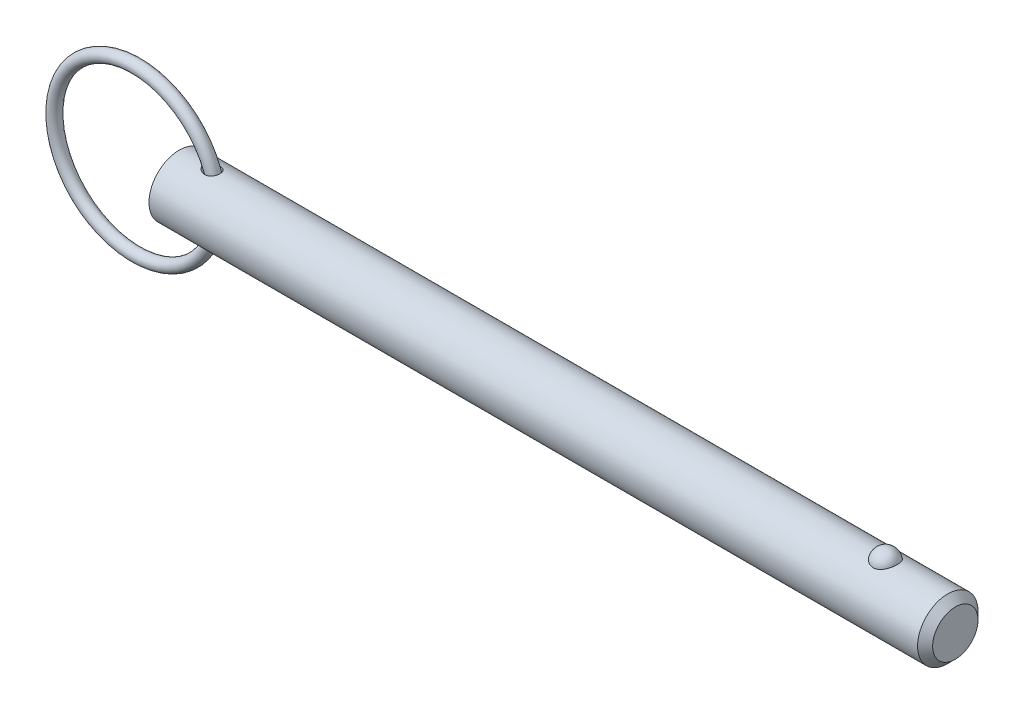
ISO-10303-21;
HEADER;
FILE_DESCRIPTION(('STEP AP214'),'2;1');
FILE_NAME('part.step','',(''),(''),'','','');
FILE_SCHEMA(('AUTOMOTIVE_DESIGN { 1 0 10303 214 1 1 1 1 }'));
ENDSEC;
DATA;
#1=APPLICATION_CONTEXT('core data for automotive mechanical design processes');
#2=APPLICATION_PROTOCOL_DEFINITION('international standard','automotive_design',2000,#1);
#3=PRODUCT_CONTEXT('',#1,'mechanical');
#4=PRODUCT('Part','Part','',(#3));
#5=PRODUCT_RELATED_PRODUCT_CATEGORY('part','',(#4));
#6=PRODUCT_DEFINITION_FORMATION('','',#4);
#7=PRODUCT_DEFINITION_CONTEXT('part definition',#1,'design');
#8=PRODUCT_DEFINITION('design','',#6,#7);
#9=PRODUCT_DEFINITION_SHAPE('','',#8);
#10=(LENGTH_UNIT() NAMED_UNIT(*) SI_UNIT(.MILLI.,.METRE.));
#11=(NAMED_UNIT(*) PLANE_ANGLE_UNIT() SI_UNIT($,.RADIAN.));
#12=(NAMED_UNIT(*) SI_UNIT($,.STERADIAN.) SOLID_ANGLE_UNIT());
#13=UNCERTAINTY_MEASURE_WITH_UNIT(LENGTH_MEASURE(1.E-05),#10,'distance_accuracy_value','');
#14=(GEOMETRIC_REPRESENTATION_CONTEXT(3) GLOBAL_UNCERTAINTY_ASSIGNED_CONTEXT((#13)) GLOBAL_UNIT_ASSIGNED_CONTEXT((#10,
#11,#12)) REPRESENTATION_CONTEXT('',''));
#15=CARTESIAN_POINT('',(0.,0.,0.));
#16=DIRECTION('',(0.,0.,1.));
#17=DIRECTION('',(1.,0.,0.));
#18=AXIS2_PLACEMENT_3D('',#15,#16,#17);
#19=CARTESIAN_POINT('',(-6.70471658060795,0.,0.));
#20=DIRECTION('',(0.,0.,1.));
#21=DIRECTION('',(1.,0.,0.));
#22=AXIS2_PLACEMENT_3D('',#19,#20,#21);
#23=TOROIDAL_SURFACE('',#22,12.7,0.940000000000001);
#24=CARTESIAN_POINT('',(6.93528341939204,0.,0.));
#25=VERTEX_POINT('',#24);
#26=VERTEX_LOOP('',#25);
#27=FACE_BOUND('',#26,.T.);
#28=ADVANCED_FACE('P0_F12',(#27),#23,.T.);
#29=CLOSED_SHELL('',(#28));
#30=MANIFOLD_SOLID_BREP('P0_B1',#29);
#31=CARTESIAN_POINT('',(0.,0.,0.));
#32=DIRECTION('',(1.,0.,0.));
#33=DIRECTION('',(0.,0.,-1.));
#34=AXIS2_PLACEMENT_3D('',#31,#32,#33);
#35=CYLINDRICAL_SURFACE('',#34,4.7);
#36=CARTESIAN_POINT('',(4.16378072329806,4.63584137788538,-0.773934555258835));
#37=CARTESIAN_POINT('',(4.22041228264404,4.62659903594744,-0.829297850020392));
#38=CARTESIAN_POINT('',(4.28206987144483,4.61719767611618,-0.879522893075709));
#39=CARTESIAN_POINT('',(4.41303152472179,4.59925351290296,-0.968997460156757));
#40=CARTESIAN_POINT('',(4.4823442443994,4.59071170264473,-1.00823437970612));
#41=CARTESIAN_POINT('',(4.626507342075,4.5755493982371,-1.07495006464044));
#42=CARTESIAN_POINT('',(4.70135029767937,4.56892638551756,-1.10244426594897));
#43=CARTESIAN_POINT('',(4.85470490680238,4.55848940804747,-1.14483874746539));
#44=CARTESIAN_POINT('',(4.93321503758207,4.55467428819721,-1.15974420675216));
#45=CARTESIAN_POINT('',(5.09197970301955,4.55051176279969,-1.17597559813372));
#46=CARTESIAN_POINT('',(5.17223836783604,4.55017372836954,-1.17726483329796));
#47=CARTESIAN_POINT('',(5.33159446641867,4.55326696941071,-1.16524823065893));
#48=CARTESIAN_POINT('',(5.41069268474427,4.55669556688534,-1.15195276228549));
#49=CARTESIAN_POINT('',(5.55698758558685,4.56647801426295,-1.11249214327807));
#50=CARTESIAN_POINT('',(5.62458628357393,4.57250771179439,-1.08773548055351));
#51=CARTESIAN_POINT('',(5.75397700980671,4.58665356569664,-1.02644632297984));
#52=CARTESIAN_POINT('',(5.81577171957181,4.59476875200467,-0.989919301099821));
#53=CARTESIAN_POINT('',(5.9268148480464,4.61135052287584,-0.909391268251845));
#54=CARTESIAN_POINT('',(5.9766679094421,4.61973919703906,-0.866204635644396));
#55=CARTESIAN_POINT('',(6.06817854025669,4.63643253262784,-0.771868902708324));
#56=CARTESIAN_POINT('',(6.10983710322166,4.64473720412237,-0.720720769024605));
#57=CARTESIAN_POINT('',(6.18318089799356,4.660174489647,-0.612928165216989));
#58=CARTESIAN_POINT('',(6.21503150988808,4.66732544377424,-0.556398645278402));
#59=CARTESIAN_POINT('',(6.26900210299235,4.67985590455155,-0.438689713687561));
#60=CARTESIAN_POINT('',(6.29112194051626,4.68523538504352,-0.377510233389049));
#61=CARTESIAN_POINT('',(6.32523846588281,4.6936733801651,-0.251831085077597));
#62=CARTESIAN_POINT('',(6.33717189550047,4.69671737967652,-0.187313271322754));
#63=CARTESIAN_POINT('',(6.35042407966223,4.70010386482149,-0.0571258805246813));
#64=CARTESIAN_POINT('',(6.3517424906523,4.70044626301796,0.00854373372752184));
#65=CARTESIAN_POINT('',(6.34371729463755,4.69838816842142,0.139481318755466));
#66=CARTESIAN_POINT('',(6.33432596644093,4.69597539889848,0.204746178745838));
#67=CARTESIAN_POINT('',(6.30500866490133,4.68864655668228,0.332720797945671));
#68=CARTESIAN_POINT('',(6.28508259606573,4.68373046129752,0.39543053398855));
#69=CARTESIAN_POINT('',(6.23516511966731,4.67193431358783,0.516455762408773));
#70=CARTESIAN_POINT('',(6.20518126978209,4.66505573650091,0.574774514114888));
#71=CARTESIAN_POINT('',(6.1358631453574,4.65009270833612,0.685387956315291));
#72=CARTESIAN_POINT('',(6.09652950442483,4.64200833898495,0.737683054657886));
#73=CARTESIAN_POINT('',(6.00979078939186,4.62559001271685,0.834455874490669));
#74=CARTESIAN_POINT('',(5.96243625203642,4.61725787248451,0.878979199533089));
#75=CARTESIAN_POINT('',(5.86079843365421,4.60122574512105,0.959378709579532));
#76=CARTESIAN_POINT('',(5.80651591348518,4.59352568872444,0.995255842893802));
#77=CARTESIAN_POINT('',(5.69277386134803,4.57961669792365,1.05741527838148));
#78=CARTESIAN_POINT('',(5.63333134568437,4.57340309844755,1.08372773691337));
#79=CARTESIAN_POINT('',(5.5108424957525,4.56305640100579,1.12650026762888));
#80=CARTESIAN_POINT('',(5.44779577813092,4.55892352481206,1.14295928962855));
#81=CARTESIAN_POINT('',(5.3179566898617,4.55299444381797,1.1663590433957));
#82=CARTESIAN_POINT('',(5.25110869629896,4.55127026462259,1.17300670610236));
#83=CARTESIAN_POINT('',(5.11716812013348,4.55043953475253,1.17622268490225));
#84=CARTESIAN_POINT('',(5.05007546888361,4.55133378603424,1.17278791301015));
#85=CARTESIAN_POINT('',(4.91166083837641,4.55569951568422,1.15571913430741));
#86=CARTESIAN_POINT('',(4.84044690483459,4.55937764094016,1.1412666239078));
#87=CARTESIAN_POINT('',(4.70108819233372,4.56903562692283,1.10196123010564));
#88=CARTESIAN_POINT('',(4.63294574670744,4.57501720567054,1.07710058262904));
#89=CARTESIAN_POINT('',(4.4947730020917,4.58927184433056,1.01474439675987));
#90=CARTESIAN_POINT('',(4.42520748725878,4.59771156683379,0.976252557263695));
#91=CARTESIAN_POINT('',(4.29354165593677,4.61552030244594,0.888246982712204));
#92=CARTESIAN_POINT('',(4.23143936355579,4.62488906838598,0.838736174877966));
#93=CARTESIAN_POINT('',(4.12609666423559,4.64192969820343,0.738015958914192));
#94=CARTESIAN_POINT('',(4.08142630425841,4.64963595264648,0.688308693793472));
#95=CARTESIAN_POINT('',(4.0008117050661,4.66411457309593,0.582144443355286));
#96=CARTESIAN_POINT('',(3.96485623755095,4.6708881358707,0.525696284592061));
#97=CARTESIAN_POINT('',(3.9081839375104,4.68183565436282,0.41591755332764));
#98=CARTESIAN_POINT('',(3.88599581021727,4.68624644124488,0.363372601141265));
#99=CARTESIAN_POINT('',(3.85055971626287,4.693376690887,0.255230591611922));
#100=CARTESIAN_POINT('',(3.83730635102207,4.69609717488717,0.199635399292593));
#101=CARTESIAN_POINT('',(3.82058225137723,4.69954043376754,0.0867104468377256));
#102=CARTESIAN_POINT('',(3.81714632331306,4.70025610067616,0.0293752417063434));
#103=CARTESIAN_POINT('',(3.8204140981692,4.69957935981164,-0.084992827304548));
#104=CARTESIAN_POINT('',(3.82711802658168,4.69818690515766,-0.142025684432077));
#105=CARTESIAN_POINT('',(3.84950128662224,4.69360426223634,-0.250744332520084));
#106=CARTESIAN_POINT('',(3.86463891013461,4.69052274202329,-0.302548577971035));
#107=CARTESIAN_POINT('',(3.9026119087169,4.68295207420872,-0.403121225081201));
#108=CARTESIAN_POINT('',(3.92544863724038,4.67846267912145,-0.451889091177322));
#109=CARTESIAN_POINT('',(3.9799930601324,4.6680441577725,-0.549522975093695));
#110=CARTESIAN_POINT('',(4.01228648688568,4.66202553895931,-0.598050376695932));
#111=CARTESIAN_POINT('',(4.08340845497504,4.64931397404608,-0.689954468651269));
#112=CARTESIAN_POINT('',(4.1222426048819,4.64262045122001,-0.733326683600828));
#113=CARTESIAN_POINT('',(4.16378072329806,4.63584137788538,-0.773934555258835));
#114=B_SPLINE_CURVE_WITH_KNOTS('',3,(#36,#37,#38,#39,#40,#41,#42,#43,#44,#45,#46,#47,#48,#49,
#50,#51,#52,#53,#54,#55,#56,#57,#58,#59,#60,#61,#62,#63,#64,#65,#66,#67,#68,#69,#70,#71,#72,#73,
#74,#75,#76,#77,#78,#79,#80,#81,#82,#83,#84,#85,#86,#87,#88,#89,#90,#91,#92,#93,#94,#95,#96,#97,
#98,#99,#100,#101,#102,#103,#104,#105,#106,#107,#108,#109,#110,#111,#112,#113),.UNSPECIFIED.,
.T.,.F.,(4,2,2,2,2,2,2,2,2,2,2,2,2,2,2,2,2,2,2,2,2,2,2,2,2,2,2,2,2,2,2,2,2,2,2,2,2,2,4),(0.,
0.238977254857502,0.478227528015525,0.717162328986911,0.955998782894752,1.19547875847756,
1.43478857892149,1.65034375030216,1.86579883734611,2.06429861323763,2.2627743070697,
2.45769248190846,2.65261353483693,2.848736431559,3.04486567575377,3.24187227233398,
3.43888065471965,3.63574133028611,3.83258866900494,4.0282389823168,4.22386782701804,
4.41887441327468,4.61390177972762,4.81464443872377,5.0154485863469,5.23282834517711,
5.45037055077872,5.68914354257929,5.9278531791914,6.12887730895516,6.32964104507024,
6.50053592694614,6.67132745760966,6.84272375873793,7.01412387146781,7.17560768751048,
7.33711990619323,7.51225400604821,7.68753905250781),.UNSPECIFIED.);
#115=CARTESIAN_POINT('',(4.16378072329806,4.63584137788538,-0.773934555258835));
#116=VERTEX_POINT('',#115);
#117=EDGE_CURVE('P1_E40',#116,#116,#114,.T.);
#118=ORIENTED_EDGE('',*,*,#117,.T.);
#119=EDGE_LOOP('',(#118));
#120=FACE_BOUND('',#119,.T.);
#121=CARTESIAN_POINT('',(119.475,0.,0.));
#122=DIRECTION('',(1.,0.,0.));
#123=DIRECTION('',(0.,0.,-1.));
#124=AXIS2_PLACEMENT_3D('',#121,#122,#123);
#125=CIRCLE('',#124,4.7);
#126=CARTESIAN_POINT('',(119.475,0.,-4.7));
#127=VERTEX_POINT('',#126);
#128=EDGE_CURVE('P1_E25',#127,#127,#125,.T.);
#129=ORIENTED_EDGE('',*,*,#128,.F.);
#130=EDGE_LOOP('',(#129));
#131=FACE_BOUND('',#130,.T.);
#132=CARTESIAN_POINT('',(0.,0.,0.));
#133=DIRECTION('',(1.,0.,0.));
#134=DIRECTION('',(0.,0.,-1.));
#135=AXIS2_PLACEMENT_3D('',#132,#133,#134);
#136=CIRCLE('',#135,4.7);
#137=CARTESIAN_POINT('',(0.,0.,-4.7));
#138=VERTEX_POINT('',#137);
#139=EDGE_CURVE('P1_E9',#138,#138,#136,.T.);
#140=ORIENTED_EDGE('',*,*,#139,.T.);
#141=EDGE_LOOP('',(#140));
#142=FACE_BOUND('',#141,.T.);
#143=CARTESIAN_POINT('',(109.78062830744,4.30387706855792,1.88855557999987));
#144=CARTESIAN_POINT('',(109.682813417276,4.30388592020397,1.88854684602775));
#145=CARTESIAN_POINT('',(109.584851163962,4.30731231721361,1.88078712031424));
#146=CARTESIAN_POINT('',(109.391662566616,4.32065009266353,1.84993192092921));
#147=CARTESIAN_POINT('',(109.296443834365,4.33057798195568,1.82679740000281));
#148=CARTESIAN_POINT('',(109.11181755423,4.3557457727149,1.76594245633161));
#149=CARTESIAN_POINT('',(109.022395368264,4.37097162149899,1.72826059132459));
#150=CARTESIAN_POINT('',(108.851390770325,4.4050778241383,1.6393730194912));
#151=CARTESIAN_POINT('',(108.769805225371,4.4239567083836,1.58817274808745));
#152=CARTESIAN_POINT('',(108.613901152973,4.46404088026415,1.47181116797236));
#153=CARTESIAN_POINT('',(108.539875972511,4.48529915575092,1.40627540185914));
#154=CARTESIAN_POINT('',(108.403536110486,4.527485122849,1.26387806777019));
#155=CARTESIAN_POINT('',(108.341224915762,4.54841271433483,1.18701313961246));
#156=CARTESIAN_POINT('',(108.227072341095,4.58876216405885,1.02025841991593));
#157=CARTESIAN_POINT('',(108.175811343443,4.60807744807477,0.929944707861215));
#158=CARTESIAN_POINT('',(108.08842456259,4.6421320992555,0.741468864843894));
#159=CARTESIAN_POINT('',(108.052299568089,4.65687122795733,0.643306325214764));
#160=CARTESIAN_POINT('',(107.995671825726,4.68038485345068,0.440967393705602));
#161=CARTESIAN_POINT('',(107.975304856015,4.68910744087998,0.336746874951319));
#162=CARTESIAN_POINT('',(107.951132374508,4.69949255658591,0.126059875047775));
#163=CARTESIAN_POINT('',(107.947326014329,4.70115544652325,0.0195935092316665));
#164=CARTESIAN_POINT('',(107.956308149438,4.69727256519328,-0.191500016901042));
#165=CARTESIAN_POINT('',(107.968941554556,4.69179416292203,-0.296135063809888));
#166=CARTESIAN_POINT('',(108.010276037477,4.67429351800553,-0.501612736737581));
#167=CARTESIAN_POINT('',(108.038977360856,4.66227117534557,-0.602455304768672));
#168=CARTESIAN_POINT('',(108.111928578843,4.63286427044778,-0.79770793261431));
#169=CARTESIAN_POINT('',(108.156204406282,4.61547077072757,-0.892106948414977));
#170=CARTESIAN_POINT('',(108.259407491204,4.57709900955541,-1.07173134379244));
#171=CARTESIAN_POINT('',(108.318336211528,4.55612039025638,-1.15695580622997));
#172=CARTESIAN_POINT('',(108.450216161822,4.51257918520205,-1.31664252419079));
#173=CARTESIAN_POINT('',(108.523286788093,4.49000423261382,-1.39100294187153));
#174=CARTESIAN_POINT('',(108.681478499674,4.44594443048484,-1.52598548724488));
#175=CARTESIAN_POINT('',(108.766599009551,4.42445952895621,-1.58660827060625));
#176=CARTESIAN_POINT('',(108.945267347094,4.38543655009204,-1.69145998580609));
#177=CARTESIAN_POINT('',(109.038651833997,4.36783887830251,-1.73594433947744));
#178=CARTESIAN_POINT('',(109.23242205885,4.3382941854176,-1.8085227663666));
#179=CARTESIAN_POINT('',(109.332805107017,4.32634500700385,-1.83662309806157));
#180=CARTESIAN_POINT('',(109.53228752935,4.31005085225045,-1.87453136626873));
#181=CARTESIAN_POINT('',(109.631196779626,4.30535309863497,-1.88518956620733));
#182=CARTESIAN_POINT('',(109.829521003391,4.30299844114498,-1.89055986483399));
#183=CARTESIAN_POINT('',(109.928935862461,4.30534000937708,-1.88527542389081));
#184=CARTESIAN_POINT('',(110.12186386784,4.31657737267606,-1.85939299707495));
#185=CARTESIAN_POINT('',(110.215462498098,4.32524571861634,-1.83932621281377));
#186=CARTESIAN_POINT('',(110.397783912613,4.34791518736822,-1.7850744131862));
#187=CARTESIAN_POINT('',(110.486506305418,4.36191673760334,-1.75088826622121));
#188=CARTESIAN_POINT('',(110.658694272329,4.39411605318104,-1.66845234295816));
#189=CARTESIAN_POINT('',(110.742008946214,4.41239631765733,-1.61992036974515));
#190=CARTESIAN_POINT('',(110.899399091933,4.45109244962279,-1.51034589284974));
#191=CARTESIAN_POINT('',(110.973472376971,4.47150882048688,-1.44930043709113));
#192=CARTESIAN_POINT('',(111.114405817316,4.51353865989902,-1.31275193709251));
#193=CARTESIAN_POINT('',(111.180701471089,4.53515983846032,-1.23666813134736));
#194=CARTESIAN_POINT('',(111.300069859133,4.57635116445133,-1.07425533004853));
#195=CARTESIAN_POINT('',(111.35314024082,4.59592094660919,-0.987924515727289));
#196=CARTESIAN_POINT('',(111.446443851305,4.63161819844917,-0.804428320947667));
#197=CARTESIAN_POINT('',(111.486229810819,4.64762063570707,-0.707010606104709));
#198=CARTESIAN_POINT('',(111.549825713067,4.67374032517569,-0.506344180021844));
#199=CARTESIAN_POINT('',(111.573635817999,4.68385763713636,-0.403095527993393));
#200=CARTESIAN_POINT('',(111.604751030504,4.69716075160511,-0.193975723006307));
#201=CARTESIAN_POINT('',(111.612098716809,4.70036443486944,-0.088112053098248));
#202=CARTESIAN_POINT('',(111.610261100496,4.6995691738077,0.123441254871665));
#203=CARTESIAN_POINT('',(111.601076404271,4.69557049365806,0.229130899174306));
#204=CARTESIAN_POINT('',(111.566492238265,4.68082941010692,0.436545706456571));
#205=CARTESIAN_POINT('',(111.541209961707,4.67013575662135,0.53829393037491));
#206=CARTESIAN_POINT('',(111.475050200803,4.64311776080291,0.735797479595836));
#207=CARTESIAN_POINT('',(111.434171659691,4.62679303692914,0.831552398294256));
#208=CARTESIAN_POINT('',(111.337286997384,4.59002712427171,1.01512750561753));
#209=CARTESIAN_POINT('',(111.281173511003,4.56955699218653,1.10288523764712));
#210=CARTESIAN_POINT('',(111.15510852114,4.52671789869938,1.26730106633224));
#211=CARTESIAN_POINT('',(111.085157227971,4.50434896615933,1.34395933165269));
#212=CARTESIAN_POINT('',(110.932724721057,4.46008413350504,1.48428028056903));
#213=CARTESIAN_POINT('',(110.850209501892,4.43818970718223,1.54790656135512));
#214=CARTESIAN_POINT('',(110.674735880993,4.39746476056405,1.6600850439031));
#215=CARTESIAN_POINT('',(110.581773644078,4.37863537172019,1.70863168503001));
#216=CARTESIAN_POINT('',(110.391099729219,4.34688784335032,1.78783023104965));
#217=CARTESIAN_POINT('',(110.293629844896,4.33380220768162,1.81899757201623));
#218=CARTESIAN_POINT('',(110.094405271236,4.31435159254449,1.86467392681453));
#219=CARTESIAN_POINT('',(109.992663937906,4.30796708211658,1.87923136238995));
#220=CARTESIAN_POINT('',(109.85391360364,4.3043503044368,1.8874737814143));
#221=CARTESIAN_POINT('',(109.81728130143,4.30387375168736,1.8885588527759));
#222=CARTESIAN_POINT('',(109.78062830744,4.30387706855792,1.88855557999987));
#223=B_SPLINE_CURVE_WITH_KNOTS('',3,(#143,#144,#145,#146,#147,#148,#149,#150,#151,#152,#153,
#154,#155,#156,#157,#158,#159,#160,#161,#162,#163,#164,#165,#166,#167,#168,#169,#170,#171,#172,
#173,#174,#175,#176,#177,#178,#179,#180,#181,#182,#183,#184,#185,#186,#187,#188,#189,#190,#191,
#192,#193,#194,#195,#196,#197,#198,#199,#200,#201,#202,#203,#204,#205,#206,#207,#208,#209,#210,
#211,#212,#213,#214,#215,#216,#217,#218,#219,#220,#221,#222),.UNSPECIFIED.,.T.,.F.,(4,2,2,2,2,2,
2,2,2,2,2,2,2,2,2,2,2,2,2,2,2,2,2,2,2,2,2,2,2,2,2,2,2,2,2,2,2,2,2,4),(0.,0.293339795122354,
0.587427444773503,0.880740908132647,1.17393661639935,1.47597417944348,1.77810150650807,
2.09350493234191,2.40892479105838,2.72703308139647,3.04512507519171,3.36023788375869,
3.67535550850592,3.99100033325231,4.30667668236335,4.62514463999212,4.94359739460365,
5.25676407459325,5.56981105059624,5.86708641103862,6.1642972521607,6.45131888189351,
6.73836351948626,7.03148013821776,7.3246659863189,7.63288296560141,7.94115473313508,
8.25895074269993,8.57674352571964,8.89371340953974,9.21067166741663,9.52534839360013,
9.84004644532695,10.157022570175,10.4739938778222,10.7918388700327,11.1098009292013,
11.41774884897,11.7247967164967,11.834716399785),.UNSPECIFIED.);
#224=CARTESIAN_POINT('',(109.78062830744,4.30387706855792,1.88855557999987));
#225=VERTEX_POINT('',#224);
#226=EDGE_CURVE('P1_E34',#225,#225,#223,.T.);
#227=ORIENTED_EDGE('',*,*,#226,.T.);
#228=EDGE_LOOP('',(#227));
#229=FACE_BOUND('',#228,.T.);
#230=CARTESIAN_POINT('',(4.16378072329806,-4.63584137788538,-0.773934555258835));
#231=CARTESIAN_POINT('',(4.11797605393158,-4.64331682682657,-0.729154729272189));
#232=CARTESIAN_POINT('',(4.07545237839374,-4.65068929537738,-0.681007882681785));
#233=CARTESIAN_POINT('',(3.99850919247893,-4.66454993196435,-0.578483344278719));
#234=CARTESIAN_POINT('',(3.9640846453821,-4.67103864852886,-0.524109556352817));
#235=CARTESIAN_POINT('',(3.90486465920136,-4.68247538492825,-0.409579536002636));
#236=CARTESIAN_POINT('',(3.88014787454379,-4.68741075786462,-0.349380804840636));
#237=CARTESIAN_POINT('',(3.84254060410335,-4.69500854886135,-0.225256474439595));
#238=CARTESIAN_POINT('',(3.8296375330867,-4.69767338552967,-0.161334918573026));
#239=CARTESIAN_POINT('',(3.81750619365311,-4.70018000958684,-0.0396774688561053));
#240=CARTESIAN_POINT('',(3.8168623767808,-4.70031401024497,0.017913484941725));
#241=CARTESIAN_POINT('',(3.82570055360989,-4.69848615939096,0.132270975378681));
#242=CARTESIAN_POINT('',(3.83518142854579,-4.6965245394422,0.189037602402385));
#243=CARTESIAN_POINT('',(3.8627670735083,-4.69091189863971,0.296808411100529));
#244=CARTESIAN_POINT('',(3.88034293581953,-4.68736483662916,0.347956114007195));
#245=CARTESIAN_POINT('',(3.92293217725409,-4.67896699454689,0.446919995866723));
#246=CARTESIAN_POINT('',(3.94794743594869,-4.67411588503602,0.494735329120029));
#247=CARTESIAN_POINT('',(4.00723361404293,-4.66297432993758,0.590975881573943));
#248=CARTESIAN_POINT('',(4.04218787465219,-4.65658759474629,0.638966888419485));
#249=CARTESIAN_POINT('',(4.11850165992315,-4.6432741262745,0.729452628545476));
#250=CARTESIAN_POINT('',(4.15986486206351,-4.63634708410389,0.771944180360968));
#251=CARTESIAN_POINT('',(4.25563139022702,-4.62124878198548,0.858077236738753));
#252=CARTESIAN_POINT('',(4.3110472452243,-4.61307408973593,0.900593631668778));
#253=CARTESIAN_POINT('',(4.42760239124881,-4.59748077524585,0.977085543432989));
#254=CARTESIAN_POINT('',(4.48874590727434,-4.59006271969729,1.01105468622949));
#255=CARTESIAN_POINT('',(4.62409915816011,-4.57577604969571,1.07399161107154));
#256=CARTESIAN_POINT('',(4.69895162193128,-4.56912175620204,1.10163764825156));
#257=CARTESIAN_POINT('',(4.85238616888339,-4.55861611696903,1.14433682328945));
#258=CARTESIAN_POINT('',(4.93096882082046,-4.55476520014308,1.15938803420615));
#259=CARTESIAN_POINT('',(5.08983848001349,-4.55053674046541,1.17587995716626));
#260=CARTESIAN_POINT('',(5.17012835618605,-4.55016559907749,1.17729558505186));
#261=CARTESIAN_POINT('',(5.32956049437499,-4.55319561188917,1.16552635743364));
#262=CARTESIAN_POINT('',(5.40870366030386,-4.55659361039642,1.15235371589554));
#263=CARTESIAN_POINT('',(5.55512154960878,-4.56632591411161,1.11311448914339));
#264=CARTESIAN_POINT('',(5.62279525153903,-4.57233592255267,1.08845479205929));
#265=CARTESIAN_POINT('',(5.75235194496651,-4.58645252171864,1.02734156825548));
#266=CARTESIAN_POINT('',(5.81423750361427,-4.59455817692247,0.990893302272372));
#267=CARTESIAN_POINT('',(5.92544729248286,-4.61112960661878,0.910507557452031));
#268=CARTESIAN_POINT('',(5.9753775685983,-4.61951638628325,0.867388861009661));
#269=CARTESIAN_POINT('',(6.06705041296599,-4.63621447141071,0.773173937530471));
#270=CARTESIAN_POINT('',(6.10879399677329,-4.64452578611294,0.722078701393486));
#271=CARTESIAN_POINT('',(6.18230323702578,-4.65998194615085,0.614385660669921));
#272=CARTESIAN_POINT('',(6.21423602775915,-4.66714520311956,0.557904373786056));
#273=CARTESIAN_POINT('',(6.26837651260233,-4.67970630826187,0.440277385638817));
#274=CARTESIAN_POINT('',(6.29058407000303,-4.68510413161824,0.379131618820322));
#275=CARTESIAN_POINT('',(6.32487950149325,-4.69358284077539,0.253506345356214));
#276=CARTESIAN_POINT('',(6.33690441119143,-4.69664929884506,0.189008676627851));
#277=CARTESIAN_POINT('',(6.3503414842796,-4.70008248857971,0.0588455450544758));
#278=CARTESIAN_POINT('',(6.35175330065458,-4.70044913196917,-0.00681995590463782));
#279=CARTESIAN_POINT('',(6.34391515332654,-4.69843881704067,-0.137767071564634));
#280=CARTESIAN_POINT('',(6.33461722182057,-4.69604951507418,-0.203045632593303));
#281=CARTESIAN_POINT('',(6.30548404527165,-4.68876413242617,-0.331063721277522));
#282=CARTESIAN_POINT('',(6.2856487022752,-4.68386802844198,-0.393803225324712));
#283=CARTESIAN_POINT('',(6.23590713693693,-4.67210599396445,-0.514904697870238));
#284=CARTESIAN_POINT('',(6.20600824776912,-4.66524149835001,-0.573269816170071));
#285=CARTESIAN_POINT('',(6.13685224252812,-4.65029918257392,-0.683989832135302));
#286=CARTESIAN_POINT('',(6.09759575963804,-4.6422214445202,-0.736345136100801));
#287=CARTESIAN_POINT('',(6.01099960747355,-4.62580793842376,-0.833250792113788));
#288=CARTESIAN_POINT('',(5.96371037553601,-4.61747403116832,-0.87784652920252));
#289=CARTESIAN_POINT('',(5.86219002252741,-4.60143050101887,-0.958399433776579));
#290=CARTESIAN_POINT('',(5.80795966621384,-4.59372080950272,-0.994357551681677));
#291=CARTESIAN_POINT('',(5.69431062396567,-4.57978661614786,-1.05668157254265));
#292=CARTESIAN_POINT('',(5.63490936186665,-4.57355737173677,-1.08307825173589));
#293=CARTESIAN_POINT('',(5.51248756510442,-4.56317492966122,-1.12602176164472));
#294=CARTESIAN_POINT('',(5.44946662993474,-4.55902196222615,-1.1425675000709));
#295=CARTESIAN_POINT('',(5.3196775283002,-4.55305083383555,-1.16613984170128));
#296=CARTESIAN_POINT('',(5.25285368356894,-4.55130415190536,-1.17287534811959));
#297=CARTESIAN_POINT('',(5.11894995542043,-4.55042807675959,-1.17626714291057));
#298=CARTESIAN_POINT('',(5.05187000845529,-4.55129938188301,-1.17292074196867));
#299=CARTESIAN_POINT('',(4.91348721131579,-4.55561850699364,-1.15603764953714));
#300=CARTESIAN_POINT('',(4.84229084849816,-4.55927235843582,-1.14168541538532));
#301=CARTESIAN_POINT('',(4.70293860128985,-4.56888540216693,-1.10258192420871));
#302=CARTESIAN_POINT('',(4.63478566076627,-4.57484677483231,-1.07782082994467));
#303=CARTESIAN_POINT('',(4.49401200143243,-4.58932889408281,-1.01452290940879));
#304=CARTESIAN_POINT('',(4.42204931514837,-4.59808779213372,-0.974568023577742));
#305=CARTESIAN_POINT('',(4.28620227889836,-4.61656806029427,-0.88288117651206));
#306=CARTESIAN_POINT('',(4.22231268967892,-4.62628879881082,-0.831156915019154));
#307=CARTESIAN_POINT('',(4.16378072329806,-4.63584137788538,-0.773934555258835));
#308=B_SPLINE_CURVE_WITH_KNOTS('',3,(#230,#231,#232,#233,#234,#235,#236,#237,#238,#239,#240,
#241,#242,#243,#244,#245,#246,#247,#248,#249,#250,#251,#252,#253,#254,#255,#256,#257,#258,#259,
#260,#261,#262,#263,#264,#265,#266,#267,#268,#269,#270,#271,#272,#273,#274,#275,#276,#277,#278,
#279,#280,#281,#282,#283,#284,#285,#286,#287,#288,#289,#290,#291,#292,#293,#294,#295,#296,#297,
#298,#299,#300,#301,#302,#303,#304,#305,#306,#307),.UNSPECIFIED.,.T.,.F.,(4,2,2,2,2,2,2,2,2,2,2,
2,2,2,2,2,2,2,2,2,2,2,2,2,2,2,2,2,2,2,2,2,2,2,2,2,2,2,4),(0.,0.19326332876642,0.386406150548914,
0.581083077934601,0.775552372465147,0.947410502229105,1.11924964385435,1.28117818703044,
1.44314767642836,1.62161944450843,1.80019400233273,2.01034324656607,2.22064874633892,
2.45975127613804,2.69889038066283,2.93846932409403,3.1778478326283,3.39350806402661,
3.60907218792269,3.80761226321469,4.00612769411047,4.20104508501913,4.39596521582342,
4.59208201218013,4.78820522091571,4.98521027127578,5.18221715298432,5.37908078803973,
5.5759311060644,5.77158824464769,5.96722384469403,6.1622240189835,6.35724581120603,
6.55794420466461,6.75869613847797,6.97596054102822,7.19343073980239,7.44055547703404,
7.68751900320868),.UNSPECIFIED.);
#309=CARTESIAN_POINT('',(4.16378072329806,-4.63584137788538,-0.773934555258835));
#310=VERTEX_POINT('',#309);
#311=EDGE_CURVE('P1_E17',#310,#310,#308,.T.);
#312=ORIENTED_EDGE('',*,*,#311,.T.);
#313=EDGE_LOOP('',(#312));
#314=FACE_BOUND('',#313,.T.);
#315=ADVANCED_FACE('P1_F13',(#120,#131,#142,#229,#314),#35,.T.);
#316=CARTESIAN_POINT('',(0.,0.,0.));
#317=DIRECTION('',(-1.,0.,0.));
#318=DIRECTION('',(0.,0.,1.));
#319=AXIS2_PLACEMENT_3D('',#316,#317,#318);
#320=PLANE('',#319);
#321=ORIENTED_EDGE('',*,*,#139,.F.);
#322=EDGE_LOOP('',(#321));
#323=FACE_BOUND('',#322,.T.);
#324=ADVANCED_FACE('P1_F15',(#323),#320,.T.);
#325=CARTESIAN_POINT('',(120.65,0.,0.));
#326=DIRECTION('',(-1.,0.,0.));
#327=DIRECTION('',(0.,0.,1.));
#328=AXIS2_PLACEMENT_3D('',#325,#326,#327);
#329=CONICAL_SURFACE('',#328,3.52500000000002,0.785398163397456);
#330=ORIENTED_EDGE('',*,*,#128,.T.);
#331=EDGE_LOOP('',(#330));
#332=FACE_BOUND('',#331,.T.);
#333=CARTESIAN_POINT('',(120.65,0.,0.));
#334=DIRECTION('',(1.,0.,0.));
#335=DIRECTION('',(0.,0.,-1.));
#336=AXIS2_PLACEMENT_3D('',#333,#334,#335);
#337=CIRCLE('',#336,3.52500000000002);
#338=CARTESIAN_POINT('',(120.65,0.,-3.52500000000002));
#339=VERTEX_POINT('',#338);
#340=EDGE_CURVE('P1_E30',#339,#339,#337,.T.);
#341=ORIENTED_EDGE('',*,*,#340,.F.);
#342=EDGE_LOOP('',(#341));
#343=FACE_BOUND('',#342,.T.);
#344=ADVANCED_FACE('P1_F55',(#332,#343),#329,.T.);
#345=CARTESIAN_POINT('',(120.65,3.52500000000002,0.));
#346=DIRECTION('',(1.,0.,0.));
#347=DIRECTION('',(0.,0.,-1.));
#348=AXIS2_PLACEMENT_3D('',#345,#346,#347);
#349=PLANE('',#348);
#350=ORIENTED_EDGE('',*,*,#340,.T.);
#351=EDGE_LOOP('',(#350));
#352=FACE_BOUND('',#351,.T.);
#353=ADVANCED_FACE('P1_F51',(#352),#349,.T.);
#354=CARTESIAN_POINT('',(109.78062830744,4.23,0.));
#355=DIRECTION('',(-1.,0.,0.));
#356=DIRECTION('',(0.,1.,0.));
#357=AXIS2_PLACEMENT_3D('',#354,#355,#356);
#358=SPHERICAL_SURFACE('',#357,1.89);
#359=ORIENTED_EDGE('',*,*,#226,.F.);
#360=EDGE_LOOP('',(#359));
#361=FACE_BOUND('',#360,.T.);
#362=ADVANCED_FACE('P1_F46',(#361),#358,.T.);
#363=CARTESIAN_POINT('',(-6.70471658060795,0.,0.));
#364=DIRECTION('',(0.,0.,1.));
#365=DIRECTION('',(1.,0.,0.));
#366=AXIS2_PLACEMENT_3D('',#363,#364,#365);
#367=TOROIDAL_SURFACE('',#366,12.7,1.175);
#368=ORIENTED_EDGE('',*,*,#311,.F.);
#369=EDGE_LOOP('',(#368));
#370=FACE_BOUND('',#369,.T.);
#371=ORIENTED_EDGE('',*,*,#117,.F.);
#372=EDGE_LOOP('',(#371));
#373=FACE_BOUND('',#372,.T.);
#374=ADVANCED_FACE('P1_F50',(#370,#373),#367,.F.);
#375=CLOSED_SHELL('',(#315,#324,#344,#353,#362,#374));
#376=MANIFOLD_SOLID_BREP('P1_B1',#375);
#377=ADVANCED_BREP_SHAPE_REPRESENTATION('',(#18,#30,#376),#14);
#378=SHAPE_DEFINITION_REPRESENTATION(#9,#377);
ENDSEC;
END-ISO-10303-21;
